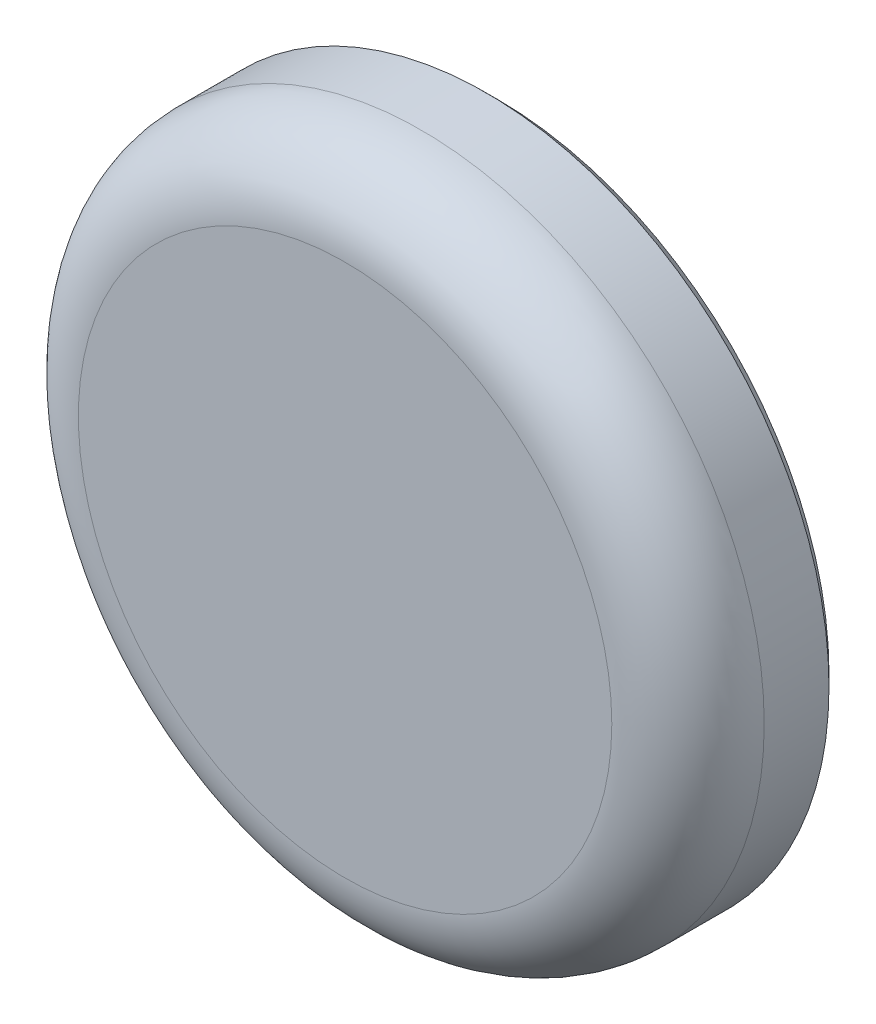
ISO-10303-21;
HEADER;
FILE_DESCRIPTION(('STEP AP214'),'2;1');
FILE_NAME('part.step','',(''),(''),'','','');
FILE_SCHEMA(('AUTOMOTIVE_DESIGN { 1 0 10303 214 1 1 1 1 }'));
ENDSEC;
DATA;
#1=APPLICATION_CONTEXT('core data for automotive mechanical design processes');
#2=APPLICATION_PROTOCOL_DEFINITION('international standard','automotive_design',2000,#1);
#3=PRODUCT_CONTEXT('',#1,'mechanical');
#4=PRODUCT('Part','Part','',(#3));
#5=PRODUCT_RELATED_PRODUCT_CATEGORY('part','',(#4));
#6=PRODUCT_DEFINITION_FORMATION('','',#4);
#7=PRODUCT_DEFINITION_CONTEXT('part definition',#1,'design');
#8=PRODUCT_DEFINITION('design','',#6,#7);
#9=PRODUCT_DEFINITION_SHAPE('','',#8);
#10=(LENGTH_UNIT() NAMED_UNIT(*) SI_UNIT(.MILLI.,.METRE.));
#11=(NAMED_UNIT(*) PLANE_ANGLE_UNIT() SI_UNIT($,.RADIAN.));
#12=(NAMED_UNIT(*) SI_UNIT($,.STERADIAN.) SOLID_ANGLE_UNIT());
#13=UNCERTAINTY_MEASURE_WITH_UNIT(LENGTH_MEASURE(1.E-05),#10,'distance_accuracy_value','');
#14=(GEOMETRIC_REPRESENTATION_CONTEXT(3) GLOBAL_UNCERTAINTY_ASSIGNED_CONTEXT((#13)) GLOBAL_UNIT_ASSIGNED_CONTEXT((#10,
#11,#12)) REPRESENTATION_CONTEXT('',''));
#15=CARTESIAN_POINT('',(0.,0.,0.));
#16=DIRECTION('',(0.,0.,1.));
#17=DIRECTION('',(1.,0.,0.));
#18=AXIS2_PLACEMENT_3D('',#15,#16,#17);
#19=CARTESIAN_POINT('',(0.,0.,2.));
#20=DIRECTION('',(0.,0.,-1.));
#21=DIRECTION('',(-1.,0.,0.));
#22=AXIS2_PLACEMENT_3D('',#19,#20,#21);
#23=CYLINDRICAL_SURFACE('',#22,4.5);
#24=CARTESIAN_POINT('',(0.,0.,0.149999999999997));
#25=DIRECTION('',(0.,0.,1.));
#26=DIRECTION('',(1.,0.,0.));
#27=AXIS2_PLACEMENT_3D('',#24,#25,#26);
#28=CIRCLE('',#27,4.5);
#29=CARTESIAN_POINT('',(4.5,0.,0.149999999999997));
#30=VERTEX_POINT('',#29);
#31=EDGE_CURVE('E36',#30,#30,#28,.T.);
#32=ORIENTED_EDGE('',*,*,#31,.T.);
#33=EDGE_LOOP('',(#32));
#34=FACE_BOUND('',#33,.T.);
#35=CARTESIAN_POINT('',(0.,0.,1.));
#36=DIRECTION('',(0.,0.,1.));
#37=DIRECTION('',(1.,0.,0.));
#38=AXIS2_PLACEMENT_3D('',#35,#36,#37);
#39=CIRCLE('',#38,4.5);
#40=CARTESIAN_POINT('',(4.5,0.,1.));
#41=VERTEX_POINT('',#40);
#42=EDGE_CURVE('E40',#41,#41,#39,.F.);
#43=ORIENTED_EDGE('',*,*,#42,.T.);
#44=EDGE_LOOP('',(#43));
#45=FACE_BOUND('',#44,.T.);
#46=ADVANCED_FACE('F29',(#34,#45),#23,.T.);
#47=CARTESIAN_POINT('',(0.,0.,2.));
#48=DIRECTION('',(0.,0.,1.));
#49=DIRECTION('',(1.,0.,0.));
#50=AXIS2_PLACEMENT_3D('',#47,#48,#49);
#51=PLANE('',#50);
#52=CARTESIAN_POINT('',(0.,0.,2.));
#53=DIRECTION('',(0.,0.,1.));
#54=DIRECTION('',(1.,0.,0.));
#55=AXIS2_PLACEMENT_3D('',#52,#53,#54);
#56=CIRCLE('',#55,3.5);
#57=CARTESIAN_POINT('',(3.5,0.,2.));
#58=VERTEX_POINT('',#57);
#59=EDGE_CURVE('E44',#58,#58,#56,.T.);
#60=ORIENTED_EDGE('',*,*,#59,.T.);
#61=EDGE_LOOP('',(#60));
#62=FACE_BOUND('',#61,.T.);
#63=ADVANCED_FACE('F50',(#62),#51,.T.);
#64=CARTESIAN_POINT('',(0.,0.,0.));
#65=DIRECTION('',(0.,0.,1.));
#66=DIRECTION('',(1.,0.,0.));
#67=AXIS2_PLACEMENT_3D('',#64,#65,#66);
#68=PLANE('',#67);
#69=CARTESIAN_POINT('',(0.,0.,0.));
#70=DIRECTION('',(0.,0.,1.));
#71=DIRECTION('',(1.,0.,0.));
#72=AXIS2_PLACEMENT_3D('',#69,#70,#71);
#73=CIRCLE('',#72,4.35);
#74=CARTESIAN_POINT('',(4.35,0.,0.));
#75=VERTEX_POINT('',#74);
#76=EDGE_CURVE('E10',#75,#75,#73,.F.);
#77=ORIENTED_EDGE('',*,*,#76,.T.);
#78=EDGE_LOOP('',(#77));
#79=FACE_BOUND('',#78,.T.);
#80=ADVANCED_FACE('F54',(#79),#68,.F.);
#81=CARTESIAN_POINT('',(0.,0.,1.));
#82=DIRECTION('',(0.,0.,1.));
#83=DIRECTION('',(1.,0.,0.));
#84=AXIS2_PLACEMENT_3D('',#81,#82,#83);
#85=TOROIDAL_SURFACE('',#84,3.5,1.);
#86=ORIENTED_EDGE('',*,*,#42,.F.);
#87=EDGE_LOOP('',(#86));
#88=FACE_BOUND('',#87,.T.);
#89=ORIENTED_EDGE('',*,*,#59,.F.);
#90=EDGE_LOOP('',(#89));
#91=FACE_BOUND('',#90,.T.);
#92=ADVANCED_FACE('F52',(#88,#91),#85,.T.);
#93=CARTESIAN_POINT('',(0.,0.,0.149999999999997));
#94=DIRECTION('',(0.,0.,1.));
#95=DIRECTION('',(1.,0.,0.));
#96=AXIS2_PLACEMENT_3D('',#93,#94,#95);
#97=CONICAL_SURFACE('',#96,4.5,0.785398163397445);
#98=ORIENTED_EDGE('',*,*,#76,.F.);
#99=EDGE_LOOP('',(#98));
#100=FACE_BOUND('',#99,.T.);
#101=ORIENTED_EDGE('',*,*,#31,.F.);
#102=EDGE_LOOP('',(#101));
#103=FACE_BOUND('',#102,.T.);
#104=ADVANCED_FACE('F31',(#100,#103),#97,.T.);
#105=CLOSED_SHELL('',(#46,#63,#80,#92,#104));
#106=MANIFOLD_SOLID_BREP('B2',#105);
#107=ADVANCED_BREP_SHAPE_REPRESENTATION('',(#18,#106),#14);
#108=SHAPE_DEFINITION_REPRESENTATION(#9,#107);
ENDSEC;
END-ISO-10303-21;
